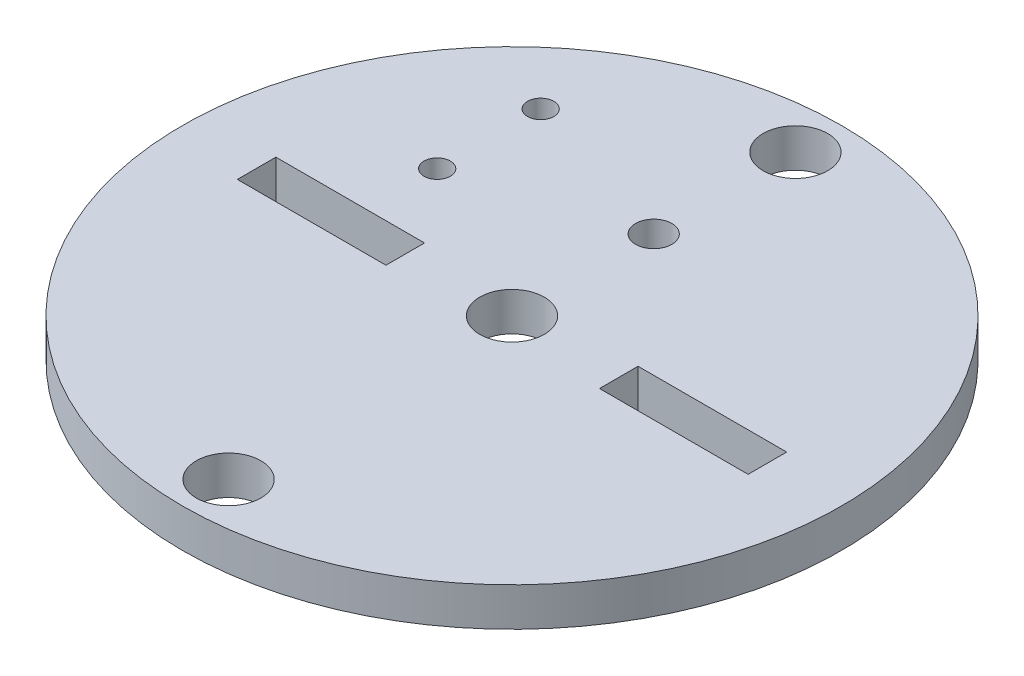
from build123d import *

# Parameters (mm, degrees)
SKETCH1_R              = 25.4
BOSS_EXTRUDE1_DEPTH    = 2.9718
F_10_CLEARANCE_HOLE1_D = 4.9784
SKETCH5_W              = 11.4554
SKETCH5_H              = 2.9718
CUT_EXTRUDE1_DEPTH     = 37.043745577
SKETCH6_R              = 1.397
SKETCH6_R_2            = 1.016
CUT_EXTRUDE2_DEPTH     = 37.043745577


with BuildPart() as part:
    # Sketch1 → Boss-Extrude1 (new body)
    with BuildSketch(Plane(origin=(0, 0, 0), x_dir=(1, 0, 0), z_dir=(0, 1, 0))):
        with Locations(Location((0, 0, 0), (0, 0, 270))):
            Circle(SKETCH1_R)
    extrude(amount=BOSS_EXTRUDE1_DEPTH)

    # 10 Clearance Hole1 (through all)
    with Locations(Plane(origin=(0, 2.9718, 0), x_dir=(1, 0, 0), z_dir=(0, 1, 0))):
        with Locations((0, 0), (0, 21.844), (0, -21.844)):
            Hole(F_10_CLEARANCE_HOLE1_D / 2)

    # Sketch5 → Cut-Extrude1 (cut, through all)
    with BuildSketch(Plane(origin=(0, 2.9718, 0), x_dir=(1, 0, 0), z_dir=(0, 1, 0))):
        with Locations((13.9573, 0)):
            Rectangle(SKETCH5_W, SKETCH5_H)
        with Locations((-13.9573, 0)):
            Rectangle(SKETCH5_W, SKETCH5_H)
    extrude(amount=-CUT_EXTRUDE1_DEPTH, mode=Mode.SUBTRACT)

    # Sketch6 → Cut-Extrude2 (cut, through all)
    with BuildSketch(Plane(origin=(0, 2.9718, 0), x_dir=(1, 0, 0), z_dir=(0, 1, 0))):
        with Locations(Location((0, 10.922, 0), (0, 0, 270))):
            Circle(SKETCH6_R)
        with Locations(Location((-12.7, 14.9098, 0), (0, 0, 270))):
            Circle(SKETCH6_R_2)
        with Locations(Location((-12.7, 6.9342, 0), (0, 0, 90))):
            Circle(SKETCH6_R_2)
    extrude(amount=-CUT_EXTRUDE2_DEPTH, mode=Mode.SUBTRACT)


solid = part.part
